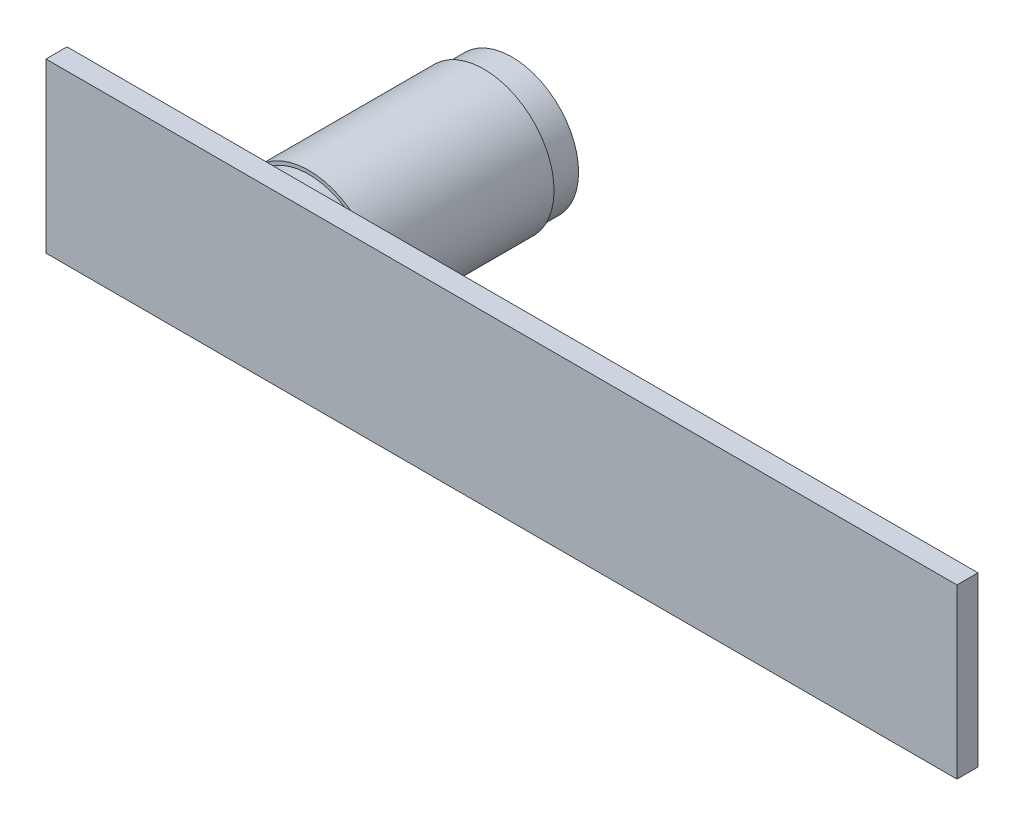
ISO-10303-21;
HEADER;
FILE_DESCRIPTION(('STEP AP214'),'2;1');
FILE_NAME('part.step','',(''),(''),'','','');
FILE_SCHEMA(('AUTOMOTIVE_DESIGN { 1 0 10303 214 1 1 1 1 }'));
ENDSEC;
DATA;
#1=APPLICATION_CONTEXT('core data for automotive mechanical design processes');
#2=APPLICATION_PROTOCOL_DEFINITION('international standard','automotive_design',2000,#1);
#3=PRODUCT_CONTEXT('',#1,'mechanical');
#4=PRODUCT('Part','Part','',(#3));
#5=PRODUCT_RELATED_PRODUCT_CATEGORY('part','',(#4));
#6=PRODUCT_DEFINITION_FORMATION('','',#4);
#7=PRODUCT_DEFINITION_CONTEXT('part definition',#1,'design');
#8=PRODUCT_DEFINITION('design','',#6,#7);
#9=PRODUCT_DEFINITION_SHAPE('','',#8);
#10=(LENGTH_UNIT() NAMED_UNIT(*) SI_UNIT(.MILLI.,.METRE.));
#11=(NAMED_UNIT(*) PLANE_ANGLE_UNIT() SI_UNIT($,.RADIAN.));
#12=(NAMED_UNIT(*) SI_UNIT($,.STERADIAN.) SOLID_ANGLE_UNIT());
#13=UNCERTAINTY_MEASURE_WITH_UNIT(LENGTH_MEASURE(1.E-05),#10,'distance_accuracy_value','');
#14=(GEOMETRIC_REPRESENTATION_CONTEXT(3) GLOBAL_UNCERTAINTY_ASSIGNED_CONTEXT((#13)) GLOBAL_UNIT_ASSIGNED_CONTEXT((#10,
#11,#12)) REPRESENTATION_CONTEXT('',''));
#15=CARTESIAN_POINT('',(0.,0.,0.));
#16=DIRECTION('',(0.,0.,1.));
#17=DIRECTION('',(1.,0.,0.));
#18=AXIS2_PLACEMENT_3D('',#15,#16,#17);
#19=CARTESIAN_POINT('',(88.5,-8.78250645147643,30.6234162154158));
#20=DIRECTION('',(0.,0.,-1.));
#21=DIRECTION('',(1.,0.,0.));
#22=AXIS2_PLACEMENT_3D('',#19,#20,#21);
#23=PLANE('',#22);
#24=CARTESIAN_POINT('',(88.5,-8.78250645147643,30.6234162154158));
#25=DIRECTION('',(0.,0.,1.));
#26=DIRECTION('',(1.,0.,0.));
#27=AXIS2_PLACEMENT_3D('',#24,#25,#26);
#28=CIRCLE('',#27,5.);
#29=CARTESIAN_POINT('',(93.5,-8.78250645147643,30.6234162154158));
#30=VERTEX_POINT('',#29);
#31=EDGE_CURVE('E119',#30,#30,#28,.T.);
#32=ORIENTED_EDGE('',*,*,#31,.F.);
#33=EDGE_LOOP('',(#32));
#34=FACE_BOUND('',#33,.T.);
#35=DIRECTION('',(0.,1.,0.));
#36=VECTOR('',#35,1.);
#37=CARTESIAN_POINT('',(84.5,-9.78250645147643,30.6234162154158));
#38=LINE('',#37,#36);
#39=CARTESIAN_POINT('',(84.5,-9.78250645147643,30.6234162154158));
#40=VERTEX_POINT('',#39);
#41=CARTESIAN_POINT('',(84.5,-7.78250645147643,30.6234162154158));
#42=VERTEX_POINT('',#41);
#43=EDGE_CURVE('E112',#40,#42,#38,.T.);
#44=ORIENTED_EDGE('',*,*,#43,.F.);
#45=DIRECTION('',(1.,0.,0.));
#46=VECTOR('',#45,1.);
#47=CARTESIAN_POINT('',(88.5,-9.78250645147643,30.6234162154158));
#48=LINE('',#47,#46);
#49=CARTESIAN_POINT('',(92.5,-9.78250645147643,30.6234162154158));
#50=VERTEX_POINT('',#49);
#51=EDGE_CURVE('E11',#40,#50,#48,.T.);
#52=ORIENTED_EDGE('',*,*,#51,.T.);
#53=DIRECTION('',(0.,1.,0.));
#54=VECTOR('',#53,1.);
#55=CARTESIAN_POINT('',(92.5,-9.78250645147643,30.6234162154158));
#56=LINE('',#55,#54);
#57=CARTESIAN_POINT('',(92.5,-7.78250645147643,30.6234162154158));
#58=VERTEX_POINT('',#57);
#59=EDGE_CURVE('E104',#50,#58,#56,.T.);
#60=ORIENTED_EDGE('',*,*,#59,.T.);
#61=DIRECTION('',(1.,0.,0.));
#62=VECTOR('',#61,1.);
#63=CARTESIAN_POINT('',(88.5,-7.78250645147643,30.6234162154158));
#64=LINE('',#63,#62);
#65=EDGE_CURVE('E47',#42,#58,#64,.T.);
#66=ORIENTED_EDGE('',*,*,#65,.F.);
#67=EDGE_LOOP('',(#44,#52,#60,#66));
#68=FACE_BOUND('',#67,.T.);
#69=ADVANCED_FACE('F38',(#34,#68),#23,.T.);
#70=CARTESIAN_POINT('',(-19.5,-8.78250645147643,30.6234162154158));
#71=DIRECTION('',(0.,0.,-1.));
#72=DIRECTION('',(-1.,0.,0.));
#73=AXIS2_PLACEMENT_3D('',#70,#71,#72);
#74=PLANE('',#73);
#75=CARTESIAN_POINT('',(-19.5,-8.78250645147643,30.6234162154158));
#76=DIRECTION('',(0.,0.,-1.));
#77=DIRECTION('',(-1.,0.,0.));
#78=AXIS2_PLACEMENT_3D('',#75,#76,#77);
#79=CIRCLE('',#78,5.);
#80=CARTESIAN_POINT('',(-24.5,-8.78250645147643,30.6234162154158));
#81=VERTEX_POINT('',#80);
#82=EDGE_CURVE('E141',#81,#81,#79,.T.);
#83=ORIENTED_EDGE('',*,*,#82,.T.);
#84=EDGE_LOOP('',(#83));
#85=FACE_BOUND('',#84,.T.);
#86=DIRECTION('',(0.,1.,0.));
#87=VECTOR('',#86,1.);
#88=CARTESIAN_POINT('',(-23.5,-9.78250645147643,30.6234162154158));
#89=LINE('',#88,#87);
#90=CARTESIAN_POINT('',(-23.5,-9.78250645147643,30.6234162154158));
#91=VERTEX_POINT('',#90);
#92=CARTESIAN_POINT('',(-23.5,-7.78250645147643,30.6234162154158));
#93=VERTEX_POINT('',#92);
#94=EDGE_CURVE('E134',#91,#93,#89,.T.);
#95=ORIENTED_EDGE('',*,*,#94,.F.);
#96=DIRECTION('',(1.,0.,0.));
#97=VECTOR('',#96,1.);
#98=CARTESIAN_POINT('',(-19.5,-9.78250645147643,30.6234162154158));
#99=LINE('',#98,#97);
#100=CARTESIAN_POINT('',(-15.5,-9.78250645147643,30.6234162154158));
#101=VERTEX_POINT('',#100);
#102=EDGE_CURVE('E216',#91,#101,#99,.T.);
#103=ORIENTED_EDGE('',*,*,#102,.T.);
#104=DIRECTION('',(0.,1.,0.));
#105=VECTOR('',#104,1.);
#106=CARTESIAN_POINT('',(-15.5,-9.78250645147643,30.6234162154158));
#107=LINE('',#106,#105);
#108=CARTESIAN_POINT('',(-15.5,-7.78250645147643,30.6234162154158));
#109=VERTEX_POINT('',#108);
#110=EDGE_CURVE('E132',#101,#109,#107,.T.);
#111=ORIENTED_EDGE('',*,*,#110,.T.);
#112=DIRECTION('',(1.,0.,0.));
#113=VECTOR('',#112,1.);
#114=CARTESIAN_POINT('',(-19.5,-7.78250645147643,30.6234162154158));
#115=LINE('',#114,#113);
#116=EDGE_CURVE('E213',#93,#109,#115,.T.);
#117=ORIENTED_EDGE('',*,*,#116,.F.);
#118=EDGE_LOOP('',(#95,#103,#111,#117));
#119=FACE_BOUND('',#118,.T.);
#120=ADVANCED_FACE('F233',(#85,#119),#74,.T.);
#121=CARTESIAN_POINT('',(0.,0.,33.6234162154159));
#122=DIRECTION('',(0.,0.,-1.));
#123=DIRECTION('',(-1.,0.,0.));
#124=AXIS2_PLACEMENT_3D('',#121,#122,#123);
#125=PLANE('',#124);
#126=CARTESIAN_POINT('',(88.5,-8.78250645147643,33.6234162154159));
#127=DIRECTION('',(0.,0.,-1.));
#128=DIRECTION('',(-1.,0.,0.));
#129=AXIS2_PLACEMENT_3D('',#126,#127,#128);
#130=CIRCLE('',#129,5.);
#131=CARTESIAN_POINT('',(83.5,-8.78250645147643,33.6234162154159));
#132=VERTEX_POINT('',#131);
#133=EDGE_CURVE('E220',#132,#132,#130,.T.);
#134=ORIENTED_EDGE('',*,*,#133,.F.);
#135=EDGE_LOOP('',(#134));
#136=FACE_BOUND('',#135,.T.);
#137=CARTESIAN_POINT('',(0.,-8.78250645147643,33.6234162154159));
#138=DIRECTION('',(0.,0.,1.));
#139=DIRECTION('',(1.,0.,0.));
#140=AXIS2_PLACEMENT_3D('',#137,#138,#139);
#141=CIRCLE('',#140,9.5);
#142=CARTESIAN_POINT('',(9.5,-8.78250645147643,33.6234162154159));
#143=VERTEX_POINT('',#142);
#144=EDGE_CURVE('E209',#143,#143,#141,.T.);
#145=ORIENTED_EDGE('',*,*,#144,.T.);
#146=EDGE_LOOP('',(#145));
#147=FACE_BOUND('',#146,.T.);
#148=DIRECTION('',(0.,1.,0.));
#149=VECTOR('',#148,1.);
#150=CARTESIAN_POINT('',(99.5,-20.7825064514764,33.6234162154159));
#151=LINE('',#150,#149);
#152=CARTESIAN_POINT('',(99.5,-20.7825064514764,33.6234162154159));
#153=VERTEX_POINT('',#152);
#154=CARTESIAN_POINT('',(99.5,3.21749354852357,33.6234162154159));
#155=VERTEX_POINT('',#154);
#156=EDGE_CURVE('E145',#153,#155,#151,.T.);
#157=ORIENTED_EDGE('',*,*,#156,.F.);
#158=DIRECTION('',(1.,0.,0.));
#159=VECTOR('',#158,1.);
#160=CARTESIAN_POINT('',(-30.5,-20.7825064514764,33.6234162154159));
#161=LINE('',#160,#159);
#162=CARTESIAN_POINT('',(-30.5,-20.7825064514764,33.6234162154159));
#163=VERTEX_POINT('',#162);
#164=EDGE_CURVE('E154',#163,#153,#161,.T.);
#165=ORIENTED_EDGE('',*,*,#164,.F.);
#166=DIRECTION('',(0.,-1.,0.));
#167=VECTOR('',#166,1.);
#168=CARTESIAN_POINT('',(-30.5,-20.7825064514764,33.6234162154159));
#169=LINE('',#168,#167);
#170=CARTESIAN_POINT('',(-30.5,3.21749354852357,33.6234162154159));
#171=VERTEX_POINT('',#170);
#172=EDGE_CURVE('E170',#171,#163,#169,.T.);
#173=ORIENTED_EDGE('',*,*,#172,.F.);
#174=DIRECTION('',(-1.,0.,0.));
#175=VECTOR('',#174,1.);
#176=CARTESIAN_POINT('',(-30.5,3.21749354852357,33.6234162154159));
#177=LINE('',#176,#175);
#178=EDGE_CURVE('E167',#155,#171,#177,.T.);
#179=ORIENTED_EDGE('',*,*,#178,.F.);
#180=EDGE_LOOP('',(#157,#165,#173,#179));
#181=FACE_BOUND('',#180,.T.);
#182=CARTESIAN_POINT('',(-19.5,-8.78250645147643,33.6234162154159));
#183=DIRECTION('',(0.,0.,-1.));
#184=DIRECTION('',(-1.,0.,0.));
#185=AXIS2_PLACEMENT_3D('',#182,#183,#184);
#186=CIRCLE('',#185,5.);
#187=CARTESIAN_POINT('',(-24.5,-8.78250645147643,33.6234162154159));
#188=VERTEX_POINT('',#187);
#189=EDGE_CURVE('E137',#188,#188,#186,.T.);
#190=ORIENTED_EDGE('',*,*,#189,.F.);
#191=EDGE_LOOP('',(#190));
#192=FACE_BOUND('',#191,.T.);
#193=ADVANCED_FACE('F239',(#136,#147,#181,#192),#125,.T.);
#194=CARTESIAN_POINT('',(0.,-8.78250645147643,33.6234162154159));
#195=DIRECTION('',(0.,0.,1.));
#196=DIRECTION('',(1.,0.,0.));
#197=AXIS2_PLACEMENT_3D('',#194,#195,#196);
#198=CYLINDRICAL_SURFACE('',#197,9.5);
#199=ORIENTED_EDGE('',*,*,#144,.F.);
#200=EDGE_LOOP('',(#199));
#201=FACE_BOUND('',#200,.T.);
#202=CARTESIAN_POINT('',(0.,-8.78250645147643,29.6234162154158));
#203=DIRECTION('',(0.,0.,1.));
#204=DIRECTION('',(1.,0.,0.));
#205=AXIS2_PLACEMENT_3D('',#202,#203,#204);
#206=CIRCLE('',#205,9.5);
#207=CARTESIAN_POINT('',(9.5,-8.78250645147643,29.6234162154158));
#208=VERTEX_POINT('',#207);
#209=EDGE_CURVE('E189',#208,#208,#206,.T.);
#210=ORIENTED_EDGE('',*,*,#209,.T.);
#211=EDGE_LOOP('',(#210));
#212=FACE_BOUND('',#211,.T.);
#213=ADVANCED_FACE('F40',(#201,#212),#198,.T.);
#214=CARTESIAN_POINT('',(0.,0.71749354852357,0.623416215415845));
#215=DIRECTION('',(0.,0.,1.));
#216=DIRECTION('',(1.,0.,0.));
#217=AXIS2_PLACEMENT_3D('',#214,#215,#216);
#218=PLANE('',#217);
#219=CARTESIAN_POINT('',(0.,-8.78250645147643,0.623416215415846));
#220=DIRECTION('',(0.,0.,1.));
#221=DIRECTION('',(1.,0.,0.));
#222=AXIS2_PLACEMENT_3D('',#219,#220,#221);
#223=CIRCLE('',#222,9.5);
#224=CARTESIAN_POINT('',(9.5,-8.78250645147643,0.623416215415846));
#225=VERTEX_POINT('',#224);
#226=EDGE_CURVE('E205',#225,#225,#223,.T.);
#227=ORIENTED_EDGE('',*,*,#226,.F.);
#228=EDGE_LOOP('',(#227));
#229=FACE_BOUND('',#228,.T.);
#230=ADVANCED_FACE('F300',(#229),#218,.F.);
#231=CARTESIAN_POINT('',(0.,-8.78250645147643,33.6234162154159));
#232=DIRECTION('',(0.,0.,1.));
#233=DIRECTION('',(1.,0.,0.));
#234=AXIS2_PLACEMENT_3D('',#231,#232,#233);
#235=CYLINDRICAL_SURFACE('',#234,9.5);
#236=CARTESIAN_POINT('',(0.,-8.78250645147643,4.62341621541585));
#237=DIRECTION('',(0.,0.,1.));
#238=DIRECTION('',(1.,0.,0.));
#239=AXIS2_PLACEMENT_3D('',#236,#237,#238);
#240=CIRCLE('',#239,9.5);
#241=CARTESIAN_POINT('',(9.5,-8.78250645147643,4.62341621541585));
#242=VERTEX_POINT('',#241);
#243=EDGE_CURVE('E201',#242,#242,#240,.T.);
#244=ORIENTED_EDGE('',*,*,#243,.F.);
#245=EDGE_LOOP('',(#244));
#246=FACE_BOUND('',#245,.T.);
#247=ORIENTED_EDGE('',*,*,#226,.T.);
#248=EDGE_LOOP('',(#247));
#249=FACE_BOUND('',#248,.T.);
#250=ADVANCED_FACE('F297',(#246,#249),#235,.T.);
#251=CARTESIAN_POINT('',(0.,1.21749354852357,4.62341621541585));
#252=DIRECTION('',(0.,0.,1.));
#253=DIRECTION('',(1.,0.,0.));
#254=AXIS2_PLACEMENT_3D('',#251,#252,#253);
#255=PLANE('',#254);
#256=CARTESIAN_POINT('',(0.,-8.78250645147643,4.62341621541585));
#257=DIRECTION('',(0.,0.,1.));
#258=DIRECTION('',(1.,0.,0.));
#259=AXIS2_PLACEMENT_3D('',#256,#257,#258);
#260=CIRCLE('',#259,10.);
#261=CARTESIAN_POINT('',(10.,-8.78250645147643,4.62341621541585));
#262=VERTEX_POINT('',#261);
#263=EDGE_CURVE('E197',#262,#262,#260,.T.);
#264=ORIENTED_EDGE('',*,*,#263,.F.);
#265=EDGE_LOOP('',(#264));
#266=FACE_BOUND('',#265,.T.);
#267=ORIENTED_EDGE('',*,*,#243,.T.);
#268=EDGE_LOOP('',(#267));
#269=FACE_BOUND('',#268,.T.);
#270=ADVANCED_FACE('F293',(#266,#269),#255,.F.);
#271=CARTESIAN_POINT('',(0.,-8.78250645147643,33.6234162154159));
#272=DIRECTION('',(0.,0.,1.));
#273=DIRECTION('',(1.,0.,0.));
#274=AXIS2_PLACEMENT_3D('',#271,#272,#273);
#275=CYLINDRICAL_SURFACE('',#274,10.);
#276=CARTESIAN_POINT('',(0.,-8.78250645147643,29.6234162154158));
#277=DIRECTION('',(0.,0.,1.));
#278=DIRECTION('',(1.,0.,0.));
#279=AXIS2_PLACEMENT_3D('',#276,#277,#278);
#280=CIRCLE('',#279,10.);
#281=CARTESIAN_POINT('',(10.,-8.78250645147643,29.6234162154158));
#282=VERTEX_POINT('',#281);
#283=EDGE_CURVE('E193',#282,#282,#280,.T.);
#284=ORIENTED_EDGE('',*,*,#283,.F.);
#285=EDGE_LOOP('',(#284));
#286=FACE_BOUND('',#285,.T.);
#287=ORIENTED_EDGE('',*,*,#263,.T.);
#288=EDGE_LOOP('',(#287));
#289=FACE_BOUND('',#288,.T.);
#290=ADVANCED_FACE('F289',(#286,#289),#275,.T.);
#291=CARTESIAN_POINT('',(0.,1.21749354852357,29.6234162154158));
#292=DIRECTION('',(0.,0.,-1.));
#293=DIRECTION('',(-1.,0.,0.));
#294=AXIS2_PLACEMENT_3D('',#291,#292,#293);
#295=PLANE('',#294);
#296=ORIENTED_EDGE('',*,*,#209,.F.);
#297=EDGE_LOOP('',(#296));
#298=FACE_BOUND('',#297,.T.);
#299=ORIENTED_EDGE('',*,*,#283,.T.);
#300=EDGE_LOOP('',(#299));
#301=FACE_BOUND('',#300,.T.);
#302=ADVANCED_FACE('F285',(#298,#301),#295,.F.);
#303=CARTESIAN_POINT('',(99.5,-20.7825064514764,36.6234162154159));
#304=DIRECTION('',(-1.,0.,0.));
#305=DIRECTION('',(0.,0.,1.));
#306=AXIS2_PLACEMENT_3D('',#303,#304,#305);
#307=PLANE('',#306);
#308=ORIENTED_EDGE('',*,*,#156,.T.);
#309=DIRECTION('',(0.,0.,-1.));
#310=VECTOR('',#309,1.);
#311=CARTESIAN_POINT('',(99.5,3.21749354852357,36.6234162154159));
#312=LINE('',#311,#310);
#313=CARTESIAN_POINT('',(99.5,3.21749354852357,36.6234162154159));
#314=VERTEX_POINT('',#313);
#315=EDGE_CURVE('E186',#314,#155,#312,.T.);
#316=ORIENTED_EDGE('',*,*,#315,.F.);
#317=DIRECTION('',(0.,1.,0.));
#318=VECTOR('',#317,1.);
#319=CARTESIAN_POINT('',(99.5,-20.7825064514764,36.6234162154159));
#320=LINE('',#319,#318);
#321=CARTESIAN_POINT('',(99.5,-20.7825064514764,36.6234162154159));
#322=VERTEX_POINT('',#321);
#323=EDGE_CURVE('E149',#322,#314,#320,.T.);
#324=ORIENTED_EDGE('',*,*,#323,.F.);
#325=DIRECTION('',(0.,0.,-1.));
#326=VECTOR('',#325,1.);
#327=CARTESIAN_POINT('',(99.5,-20.7825064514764,36.6234162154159));
#328=LINE('',#327,#326);
#329=EDGE_CURVE('E163',#322,#153,#328,.T.);
#330=ORIENTED_EDGE('',*,*,#329,.T.);
#331=EDGE_LOOP('',(#308,#316,#324,#330));
#332=FACE_BOUND('',#331,.T.);
#333=ADVANCED_FACE('F281',(#332),#307,.F.);
#334=CARTESIAN_POINT('',(-30.5,3.21749354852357,36.6234162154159));
#335=DIRECTION('',(0.,-1.,0.));
#336=DIRECTION('',(0.,0.,-1.));
#337=AXIS2_PLACEMENT_3D('',#334,#335,#336);
#338=PLANE('',#337);
#339=ORIENTED_EDGE('',*,*,#178,.T.);
#340=DIRECTION('',(0.,0.,-1.));
#341=VECTOR('',#340,1.);
#342=CARTESIAN_POINT('',(-30.5,3.21749354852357,36.6234162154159));
#343=LINE('',#342,#341);
#344=CARTESIAN_POINT('',(-30.5,3.21749354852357,36.6234162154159));
#345=VERTEX_POINT('',#344);
#346=EDGE_CURVE('E182',#345,#171,#343,.T.);
#347=ORIENTED_EDGE('',*,*,#346,.F.);
#348=DIRECTION('',(-1.,0.,0.));
#349=VECTOR('',#348,1.);
#350=CARTESIAN_POINT('',(-30.5,3.21749354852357,36.6234162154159));
#351=LINE('',#350,#349);
#352=EDGE_CURVE('E153',#314,#345,#351,.T.);
#353=ORIENTED_EDGE('',*,*,#352,.F.);
#354=ORIENTED_EDGE('',*,*,#315,.T.);
#355=EDGE_LOOP('',(#339,#347,#353,#354));
#356=FACE_BOUND('',#355,.T.);
#357=ADVANCED_FACE('F277',(#356),#338,.F.);
#358=CARTESIAN_POINT('',(-30.5,-20.7825064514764,36.6234162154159));
#359=DIRECTION('',(1.,0.,0.));
#360=DIRECTION('',(0.,0.,-1.));
#361=AXIS2_PLACEMENT_3D('',#358,#359,#360);
#362=PLANE('',#361);
#363=ORIENTED_EDGE('',*,*,#172,.T.);
#364=DIRECTION('',(0.,0.,-1.));
#365=VECTOR('',#364,1.);
#366=CARTESIAN_POINT('',(-30.5,-20.7825064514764,36.6234162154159));
#367=LINE('',#366,#365);
#368=CARTESIAN_POINT('',(-30.5,-20.7825064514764,36.6234162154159));
#369=VERTEX_POINT('',#368);
#370=EDGE_CURVE('E178',#369,#163,#367,.T.);
#371=ORIENTED_EDGE('',*,*,#370,.F.);
#372=DIRECTION('',(0.,-1.,0.));
#373=VECTOR('',#372,1.);
#374=CARTESIAN_POINT('',(-30.5,-20.7825064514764,36.6234162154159));
#375=LINE('',#374,#373);
#376=EDGE_CURVE('E157',#345,#369,#375,.T.);
#377=ORIENTED_EDGE('',*,*,#376,.F.);
#378=ORIENTED_EDGE('',*,*,#346,.T.);
#379=EDGE_LOOP('',(#363,#371,#377,#378));
#380=FACE_BOUND('',#379,.T.);
#381=ADVANCED_FACE('F273',(#380),#362,.F.);
#382=CARTESIAN_POINT('',(-30.5,-20.7825064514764,36.6234162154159));
#383=DIRECTION('',(0.,1.,0.));
#384=DIRECTION('',(0.,0.,1.));
#385=AXIS2_PLACEMENT_3D('',#382,#383,#384);
#386=PLANE('',#385);
#387=ORIENTED_EDGE('',*,*,#164,.T.);
#388=ORIENTED_EDGE('',*,*,#329,.F.);
#389=DIRECTION('',(1.,0.,0.));
#390=VECTOR('',#389,1.);
#391=CARTESIAN_POINT('',(-30.5,-20.7825064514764,36.6234162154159));
#392=LINE('',#391,#390);
#393=EDGE_CURVE('E160',#369,#322,#392,.T.);
#394=ORIENTED_EDGE('',*,*,#393,.F.);
#395=ORIENTED_EDGE('',*,*,#370,.T.);
#396=EDGE_LOOP('',(#387,#388,#394,#395));
#397=FACE_BOUND('',#396,.T.);
#398=ADVANCED_FACE('F266',(#397),#386,.F.);
#399=CARTESIAN_POINT('',(0.,0.,36.6234162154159));
#400=DIRECTION('',(0.,0.,-1.));
#401=DIRECTION('',(-1.,0.,0.));
#402=AXIS2_PLACEMENT_3D('',#399,#400,#401);
#403=PLANE('',#402);
#404=ORIENTED_EDGE('',*,*,#323,.T.);
#405=ORIENTED_EDGE('',*,*,#352,.T.);
#406=ORIENTED_EDGE('',*,*,#376,.T.);
#407=ORIENTED_EDGE('',*,*,#393,.T.);
#408=EDGE_LOOP('',(#404,#405,#406,#407));
#409=FACE_BOUND('',#408,.T.);
#410=ADVANCED_FACE('F262',(#409),#403,.F.);
#411=CARTESIAN_POINT('',(-19.5,-8.78250645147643,30.6234162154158));
#412=DIRECTION('',(0.,0.,1.));
#413=DIRECTION('',(1.,0.,0.));
#414=AXIS2_PLACEMENT_3D('',#411,#412,#413);
#415=CYLINDRICAL_SURFACE('',#414,5.);
#416=ORIENTED_EDGE('',*,*,#82,.F.);
#417=EDGE_LOOP('',(#416));
#418=FACE_BOUND('',#417,.T.);
#419=ORIENTED_EDGE('',*,*,#189,.T.);
#420=EDGE_LOOP('',(#419));
#421=FACE_BOUND('',#420,.T.);
#422=ADVANCED_FACE('F257',(#418,#421),#415,.T.);
#423=CARTESIAN_POINT('',(-19.5,-9.78250645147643,26.6234162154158));
#424=DIRECTION('',(0.,1.,0.));
#425=DIRECTION('',(0.,0.,1.));
#426=AXIS2_PLACEMENT_3D('',#423,#424,#425);
#427=CYLINDRICAL_SURFACE('',#426,5.65685424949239);
#428=CARTESIAN_POINT('',(-19.5,-7.78250645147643,26.6234162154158));
#429=DIRECTION('',(0.,1.,0.));
#430=DIRECTION('',(0.,0.,1.));
#431=AXIS2_PLACEMENT_3D('',#428,#429,#430);
#432=CIRCLE('',#431,5.65685424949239);
#433=EDGE_CURVE('E60',#93,#109,#432,.T.);
#434=ORIENTED_EDGE('',*,*,#433,.T.);
#435=ORIENTED_EDGE('',*,*,#110,.F.);
#436=CARTESIAN_POINT('',(-19.5,-9.78250645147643,26.6234162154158));
#437=DIRECTION('',(0.,1.,0.));
#438=DIRECTION('',(0.,0.,1.));
#439=AXIS2_PLACEMENT_3D('',#436,#437,#438);
#440=CIRCLE('',#439,5.65685424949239);
#441=EDGE_CURVE('E128',#91,#101,#440,.T.);
#442=ORIENTED_EDGE('',*,*,#441,.F.);
#443=ORIENTED_EDGE('',*,*,#94,.T.);
#444=EDGE_LOOP('',(#434,#435,#442,#443));
#445=FACE_BOUND('',#444,.T.);
#446=ADVANCED_FACE('F252',(#445),#427,.F.);
#447=CARTESIAN_POINT('',(-19.5,-9.78250645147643,26.6234162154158));
#448=DIRECTION('',(0.,1.,0.));
#449=DIRECTION('',(0.,0.,1.));
#450=AXIS2_PLACEMENT_3D('',#447,#448,#449);
#451=PLANE('',#450);
#452=ORIENTED_EDGE('',*,*,#441,.T.);
#453=ORIENTED_EDGE('',*,*,#102,.F.);
#454=EDGE_LOOP('',(#452,#453));
#455=FACE_BOUND('',#454,.T.);
#456=ADVANCED_FACE('F249',(#455),#451,.T.);
#457=CARTESIAN_POINT('',(-19.5,-7.78250645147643,26.6234162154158));
#458=DIRECTION('',(0.,1.,0.));
#459=DIRECTION('',(0.,0.,1.));
#460=AXIS2_PLACEMENT_3D('',#457,#458,#459);
#461=PLANE('',#460);
#462=ORIENTED_EDGE('',*,*,#116,.T.);
#463=ORIENTED_EDGE('',*,*,#433,.F.);
#464=EDGE_LOOP('',(#462,#463));
#465=FACE_BOUND('',#464,.T.);
#466=ADVANCED_FACE('F247',(#465),#461,.F.);
#467=CARTESIAN_POINT('',(88.5,-8.78250645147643,30.6234162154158));
#468=DIRECTION('',(0.,0.,1.));
#469=DIRECTION('',(1.,0.,0.));
#470=AXIS2_PLACEMENT_3D('',#467,#468,#469);
#471=CYLINDRICAL_SURFACE('',#470,5.);
#472=ORIENTED_EDGE('',*,*,#31,.T.);
#473=EDGE_LOOP('',(#472));
#474=FACE_BOUND('',#473,.T.);
#475=ORIENTED_EDGE('',*,*,#133,.T.);
#476=EDGE_LOOP('',(#475));
#477=FACE_BOUND('',#476,.T.);
#478=ADVANCED_FACE('F244',(#474,#477),#471,.T.);
#479=CARTESIAN_POINT('',(88.5,-9.78250645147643,26.6234162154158));
#480=DIRECTION('',(0.,1.,0.));
#481=DIRECTION('',(0.,0.,1.));
#482=AXIS2_PLACEMENT_3D('',#479,#480,#481);
#483=CYLINDRICAL_SURFACE('',#482,5.65685424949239);
#484=CARTESIAN_POINT('',(88.5,-7.78250645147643,26.6234162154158));
#485=DIRECTION('',(0.,-1.,0.));
#486=DIRECTION('',(0.,0.,1.));
#487=AXIS2_PLACEMENT_3D('',#484,#485,#486);
#488=CIRCLE('',#487,5.65685424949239);
#489=EDGE_CURVE('E53',#58,#42,#488,.T.);
#490=ORIENTED_EDGE('',*,*,#489,.F.);
#491=ORIENTED_EDGE('',*,*,#59,.F.);
#492=CARTESIAN_POINT('',(88.5,-9.78250645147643,26.6234162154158));
#493=DIRECTION('',(0.,-1.,0.));
#494=DIRECTION('',(0.,0.,1.));
#495=AXIS2_PLACEMENT_3D('',#492,#493,#494);
#496=CIRCLE('',#495,5.65685424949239);
#497=EDGE_CURVE('E107',#50,#40,#496,.T.);
#498=ORIENTED_EDGE('',*,*,#497,.T.);
#499=ORIENTED_EDGE('',*,*,#43,.T.);
#500=EDGE_LOOP('',(#490,#491,#498,#499));
#501=FACE_BOUND('',#500,.T.);
#502=ADVANCED_FACE('F106',(#501),#483,.F.);
#503=CARTESIAN_POINT('',(88.5,-9.78250645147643,26.6234162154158));
#504=DIRECTION('',(0.,1.,0.));
#505=DIRECTION('',(0.,0.,1.));
#506=AXIS2_PLACEMENT_3D('',#503,#504,#505);
#507=PLANE('',#506);
#508=ORIENTED_EDGE('',*,*,#497,.F.);
#509=ORIENTED_EDGE('',*,*,#51,.F.);
#510=EDGE_LOOP('',(#508,#509));
#511=FACE_BOUND('',#510,.T.);
#512=ADVANCED_FACE('F115',(#511),#507,.T.);
#513=CARTESIAN_POINT('',(88.5,-7.78250645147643,26.6234162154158));
#514=DIRECTION('',(0.,1.,0.));
#515=DIRECTION('',(0.,0.,1.));
#516=AXIS2_PLACEMENT_3D('',#513,#514,#515);
#517=PLANE('',#516);
#518=ORIENTED_EDGE('',*,*,#65,.T.);
#519=ORIENTED_EDGE('',*,*,#489,.T.);
#520=EDGE_LOOP('',(#518,#519));
#521=FACE_BOUND('',#520,.T.);
#522=ADVANCED_FACE('F224',(#521),#517,.F.);
#523=CLOSED_SHELL('',(#69,#120,#193,#213,#230,#250,#270,#290,#302,#333,#357,#381,#398,#410,#422,
#446,#456,#466,#478,#502,#512,#522));
#524=MANIFOLD_SOLID_BREP('B2',#523);
#525=ADVANCED_BREP_SHAPE_REPRESENTATION('',(#18,#524),#14);
#526=SHAPE_DEFINITION_REPRESENTATION(#9,#525);
ENDSEC;
END-ISO-10303-21;
